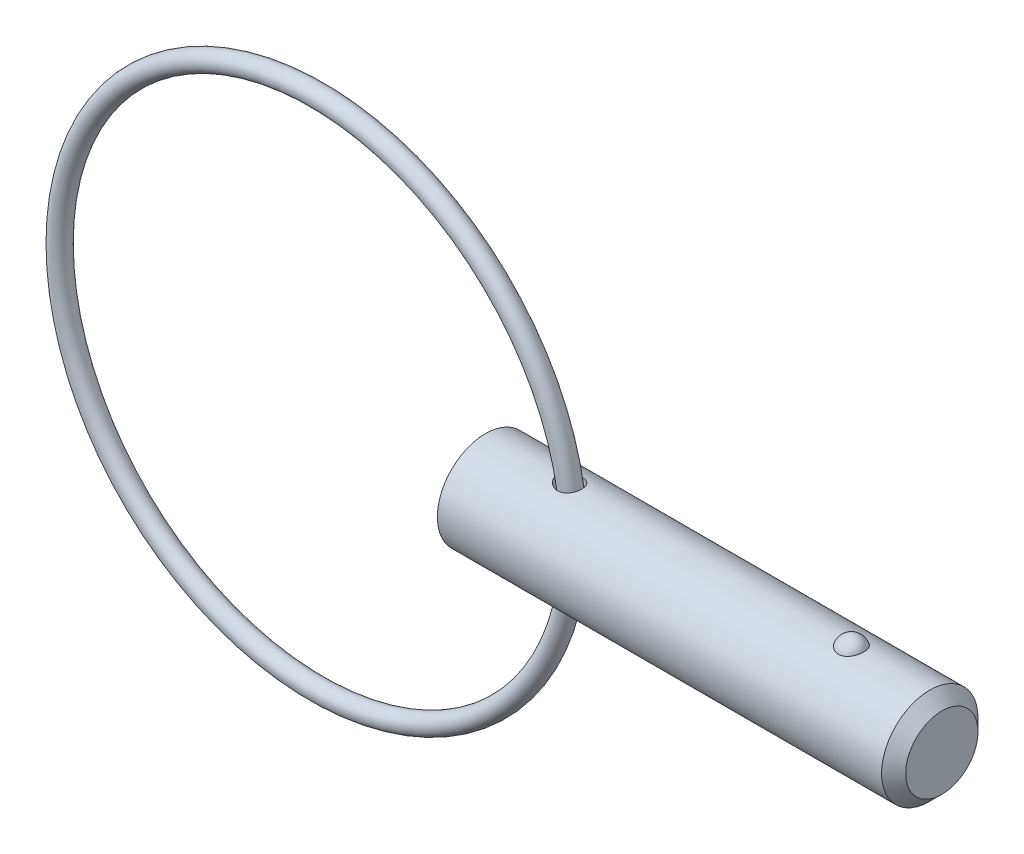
ISO-10303-21;
HEADER;
FILE_DESCRIPTION(('STEP AP214'),'2;1');
FILE_NAME('part.step','',(''),(''),'','','');
FILE_SCHEMA(('AUTOMOTIVE_DESIGN { 1 0 10303 214 1 1 1 1 }'));
ENDSEC;
DATA;
#1=APPLICATION_CONTEXT('core data for automotive mechanical design processes');
#2=APPLICATION_PROTOCOL_DEFINITION('international standard','automotive_design',2000,#1);
#3=PRODUCT_CONTEXT('',#1,'mechanical');
#4=PRODUCT('Part','Part','',(#3));
#5=PRODUCT_RELATED_PRODUCT_CATEGORY('part','',(#4));
#6=PRODUCT_DEFINITION_FORMATION('','',#4);
#7=PRODUCT_DEFINITION_CONTEXT('part definition',#1,'design');
#8=PRODUCT_DEFINITION('design','',#6,#7);
#9=PRODUCT_DEFINITION_SHAPE('','',#8);
#10=(LENGTH_UNIT() NAMED_UNIT(*) SI_UNIT(.MILLI.,.METRE.));
#11=(NAMED_UNIT(*) PLANE_ANGLE_UNIT() SI_UNIT($,.RADIAN.));
#12=(NAMED_UNIT(*) SI_UNIT($,.STERADIAN.) SOLID_ANGLE_UNIT());
#13=UNCERTAINTY_MEASURE_WITH_UNIT(LENGTH_MEASURE(1.E-05),#10,'distance_accuracy_value','');
#14=(GEOMETRIC_REPRESENTATION_CONTEXT(3) GLOBAL_UNCERTAINTY_ASSIGNED_CONTEXT((#13)) GLOBAL_UNIT_ASSIGNED_CONTEXT((#10,
#11,#12)) REPRESENTATION_CONTEXT('',''));
#15=CARTESIAN_POINT('',(0.,0.,0.));
#16=DIRECTION('',(0.,0.,1.));
#17=DIRECTION('',(1.,0.,0.));
#18=AXIS2_PLACEMENT_3D('',#15,#16,#17);
#19=CARTESIAN_POINT('',(-8.3302379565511,0.,0.));
#20=DIRECTION('',(0.,0.,1.));
#21=DIRECTION('',(1.,0.,0.));
#22=AXIS2_PLACEMENT_3D('',#19,#20,#21);
#23=TOROIDAL_SURFACE('',#22,12.7,0.476000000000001);
#24=CARTESIAN_POINT('',(4.8457620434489,0.,0.));
#25=VERTEX_POINT('',#24);
#26=VERTEX_LOOP('',#25);
#27=FACE_BOUND('',#26,.T.);
#28=ADVANCED_FACE('P0_F12',(#27),#23,.T.);
#29=CLOSED_SHELL('',(#28));
#30=MANIFOLD_SOLID_BREP('P0_B1',#29);
#31=CARTESIAN_POINT('',(0.,0.,0.));
#32=DIRECTION('',(1.,0.,0.));
#33=DIRECTION('',(0.,0.,-1.));
#34=AXIS2_PLACEMENT_3D('',#31,#32,#33);
#35=CYLINDRICAL_SURFACE('',#34,2.38);
#36=CARTESIAN_POINT('',(3.67748265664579,2.35074198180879,-0.372037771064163));
#37=CARTESIAN_POINT('',(3.70046616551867,2.34644965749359,-0.399158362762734));
#38=CARTESIAN_POINT('',(3.72581651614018,2.34199234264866,-0.424274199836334));
#39=CARTESIAN_POINT('',(3.78042747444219,2.33326580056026,-0.469907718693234));
#40=CARTESIAN_POINT('',(3.80969342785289,2.32899684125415,-0.490419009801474));
#41=CARTESIAN_POINT('',(3.87128330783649,2.32114904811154,-0.526312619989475));
#42=CARTESIAN_POINT('',(3.90360537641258,2.31756979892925,-0.541698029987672));
#43=CARTESIAN_POINT('',(3.9704452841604,2.31153734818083,-0.566889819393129));
#44=CARTESIAN_POINT('',(4.0049621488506,2.30908365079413,-0.576698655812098));
#45=CARTESIAN_POINT('',(4.07500735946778,2.30564492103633,-0.590297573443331));
#46=CARTESIAN_POINT('',(4.1105275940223,2.30465036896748,-0.594126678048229));
#47=CARTESIAN_POINT('',(4.18170718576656,2.30426876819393,-0.595606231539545));
#48=CARTESIAN_POINT('',(4.21736649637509,2.30488122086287,-0.593258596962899));
#49=CARTESIAN_POINT('',(4.28577822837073,2.30759475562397,-0.582609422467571));
#50=CARTESIAN_POINT('',(4.31858437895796,2.30961492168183,-0.574631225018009));
#51=CARTESIAN_POINT('',(4.38227060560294,2.31483318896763,-0.553233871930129));
#52=CARTESIAN_POINT('',(4.41315097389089,2.31803111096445,-0.539815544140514));
#53=CARTESIAN_POINT('',(4.4711825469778,2.3251225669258,-0.508384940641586));
#54=CARTESIAN_POINT('',(4.49841743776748,2.32899254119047,-0.490521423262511));
#55=CARTESIAN_POINT('',(4.5494826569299,2.33706025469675,-0.450515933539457));
#56=CARTESIAN_POINT('',(4.57331285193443,2.34125800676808,-0.42837379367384));
#57=CARTESIAN_POINT('',(4.6171621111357,2.34956202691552,-0.380209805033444));
#58=CARTESIAN_POINT('',(4.63714543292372,2.35366715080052,-0.354155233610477));
#59=CARTESIAN_POINT('',(4.67254725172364,2.36130301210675,-0.299034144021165));
#60=CARTESIAN_POINT('',(4.68796545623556,2.36483371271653,-0.26996743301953));
#61=CARTESIAN_POINT('',(4.71403776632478,2.37098548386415,-0.209215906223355));
#62=CARTESIAN_POINT('',(4.72462580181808,2.37359383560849,-0.177501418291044));
#63=CARTESIAN_POINT('',(4.74046966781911,2.37755210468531,-0.112692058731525));
#64=CARTESIAN_POINT('',(4.74572552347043,2.37890202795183,-0.0795971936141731));
#65=CARTESIAN_POINT('',(4.75077448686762,2.38019811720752,-0.0129544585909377));
#66=CARTESIAN_POINT('',(4.75056573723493,2.38014380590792,0.0205935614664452));
#67=CARTESIAN_POINT('',(4.74468604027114,2.37863606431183,0.0871753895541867));
#68=CARTESIAN_POINT('',(4.73901506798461,2.37718262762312,0.120209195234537));
#69=CARTESIAN_POINT('',(4.72236472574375,2.37303648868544,0.184779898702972));
#70=CARTESIAN_POINT('',(4.71139268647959,2.37034549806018,0.216318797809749));
#71=CARTESIAN_POINT('',(4.68441400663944,2.36401552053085,0.277063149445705));
#72=CARTESIAN_POINT('',(4.6684071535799,2.36037649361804,0.306268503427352));
#73=CARTESIAN_POINT('',(4.63170627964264,2.35253749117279,0.361595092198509));
#74=CARTESIAN_POINT('',(4.61100040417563,2.34833610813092,0.387708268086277));
#75=CARTESIAN_POINT('',(4.56544852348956,2.33984863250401,0.436017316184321));
#76=CARTESIAN_POINT('',(4.54060272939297,2.33556254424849,0.458213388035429));
#77=CARTESIAN_POINT('',(4.48760111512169,2.32742099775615,0.497916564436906));
#78=CARTESIAN_POINT('',(4.45946763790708,2.32356294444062,0.515452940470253));
#79=CARTESIAN_POINT('',(4.40055109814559,2.31668866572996,0.545520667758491));
#80=CARTESIAN_POINT('',(4.36976845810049,2.31367230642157,0.558052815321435));
#81=CARTESIAN_POINT('',(4.30694930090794,2.30886128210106,0.577633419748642));
#82=CARTESIAN_POINT('',(4.27493988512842,2.30704826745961,0.584764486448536));
#83=CARTESIAN_POINT('',(4.21014558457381,2.30475365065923,0.593744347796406));
#84=CARTESIAN_POINT('',(4.17736068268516,2.30427207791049,0.595593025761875));
#85=CARTESIAN_POINT('',(4.11170515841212,2.30466513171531,0.59406986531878));
#86=CARTESIAN_POINT('',(4.07883545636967,2.30554895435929,0.5906626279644));
#87=CARTESIAN_POINT('',(4.01408593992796,2.30856010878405,0.578780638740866));
#88=CARTESIAN_POINT('',(3.98220636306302,2.31068773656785,0.570304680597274));
#89=CARTESIAN_POINT('',(3.91877258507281,2.31605973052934,0.548090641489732));
#90=CARTESIAN_POINT('',(3.88730095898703,2.31935100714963,0.534128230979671));
#91=CARTESIAN_POINT('',(3.82705133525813,2.32664713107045,0.501391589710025));
#92=CARTESIAN_POINT('',(3.79827429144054,2.33065222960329,0.482615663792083));
#93=CARTESIAN_POINT('',(3.7429634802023,2.3391254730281,0.4397600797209));
#94=CARTESIAN_POINT('',(3.71658313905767,2.3436062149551,0.415484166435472));
#95=CARTESIAN_POINT('',(3.6683951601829,2.35235146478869,0.362706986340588));
#96=CARTESIAN_POINT('',(3.64658727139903,2.35661598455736,0.334205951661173));
#97=CARTESIAN_POINT('',(3.60882605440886,2.36432007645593,0.27436882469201));
#98=CARTESIAN_POINT('',(3.59274982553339,2.36777633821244,0.243112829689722));
#99=CARTESIAN_POINT('',(3.56652169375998,2.3735493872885,0.178112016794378));
#100=CARTESIAN_POINT('',(3.5563653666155,2.3758670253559,0.144369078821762));
#101=CARTESIAN_POINT('',(3.54309691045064,2.37891982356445,0.0783638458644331));
#102=CARTESIAN_POINT('',(3.53947205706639,2.37976992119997,0.0462095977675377));
#103=CARTESIAN_POINT('',(3.53785288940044,2.38014795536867,-0.018248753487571));
#104=CARTESIAN_POINT('',(3.5398575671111,2.37967612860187,-0.0505528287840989));
#105=CARTESIAN_POINT('',(3.54913867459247,2.37752661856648,-0.112617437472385));
#106=CARTESIAN_POINT('',(3.5561353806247,2.37591295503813,-0.142422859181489));
#107=CARTESIAN_POINT('',(3.5747775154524,2.37172196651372,-0.200451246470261));
#108=CARTESIAN_POINT('',(3.58642049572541,2.36914514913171,-0.228675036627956));
#109=CARTESIAN_POINT('',(3.61071901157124,2.36396321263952,-0.276620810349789));
#110=CARTESIAN_POINT('',(3.62251818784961,2.36150235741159,-0.296799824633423));
#111=CARTESIAN_POINT('',(3.64836661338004,2.35629864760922,-0.335619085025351));
#112=CARTESIAN_POINT('',(3.66241608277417,2.353555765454,-0.354259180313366));
#113=CARTESIAN_POINT('',(3.67748265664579,2.35074198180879,-0.372037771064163));
#114=B_SPLINE_CURVE_WITH_KNOTS('',3,(#36,#37,#38,#39,#40,#41,#42,#43,#44,#45,#46,#47,#48,#49,
#50,#51,#52,#53,#54,#55,#56,#57,#58,#59,#60,#61,#62,#63,#64,#65,#66,#67,#68,#69,#70,#71,#72,#73,
#74,#75,#76,#77,#78,#79,#80,#81,#82,#83,#84,#85,#86,#87,#88,#89,#90,#91,#92,#93,#94,#95,#96,#97,
#98,#99,#100,#101,#102,#103,#104,#105,#106,#107,#108,#109,#110,#111,#112,#113),.UNSPECIFIED.,
.T.,.F.,(4,2,2,2,2,2,2,2,2,2,2,2,2,2,2,2,2,2,2,2,2,2,2,2,2,2,2,2,2,2,2,2,2,2,2,2,2,2,4),(0.,
0.107335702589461,0.214819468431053,0.322238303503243,0.429609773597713,0.536277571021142,
0.642912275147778,0.743874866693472,0.844822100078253,0.942762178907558,1.04070609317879,
1.13952022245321,1.23834068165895,1.33847507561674,1.43860899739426,1.53877695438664,
1.63894536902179,1.7389756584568,1.83901017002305,1.93929990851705,2.03958453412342,
2.13922343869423,2.23884648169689,2.33691317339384,2.43498203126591,2.53371427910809,
2.63247003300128,2.73577311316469,2.83911262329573,2.94697761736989,3.05483668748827,
3.16021984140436,3.2655241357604,3.36212700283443,3.45871257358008,3.55027266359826,
3.64178456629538,3.71214035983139,3.78250304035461),.UNSPECIFIED.);
#115=CARTESIAN_POINT('',(3.67748265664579,2.35074198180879,-0.372037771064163));
#116=VERTEX_POINT('',#115);
#117=EDGE_CURVE('P1_E40',#116,#116,#114,.T.);
#118=ORIENTED_EDGE('',*,*,#117,.T.);
#119=EDGE_LOOP('',(#118));
#120=FACE_BOUND('',#119,.T.);
#121=CARTESIAN_POINT('',(21.935,0.,0.));
#122=DIRECTION('',(1.,0.,0.));
#123=DIRECTION('',(0.,0.,-1.));
#124=AXIS2_PLACEMENT_3D('',#121,#122,#123);
#125=CIRCLE('',#124,2.38);
#126=CARTESIAN_POINT('',(21.935,0.,-2.38));
#127=VERTEX_POINT('',#126);
#128=EDGE_CURVE('P1_E25',#127,#127,#125,.T.);
#129=ORIENTED_EDGE('',*,*,#128,.F.);
#130=EDGE_LOOP('',(#129));
#131=FACE_BOUND('',#130,.T.);
#132=CARTESIAN_POINT('',(0.,0.,0.));
#133=DIRECTION('',(1.,0.,0.));
#134=DIRECTION('',(0.,0.,-1.));
#135=AXIS2_PLACEMENT_3D('',#132,#133,#134);
#136=CIRCLE('',#135,2.38);
#137=CARTESIAN_POINT('',(0.,0.,-2.38));
#138=VERTEX_POINT('',#137);
#139=EDGE_CURVE('P1_E9',#138,#138,#136,.T.);
#140=ORIENTED_EDGE('',*,*,#139,.T.);
#141=EDGE_LOOP('',(#140));
#142=FACE_BOUND('',#141,.T.);
#143=CARTESIAN_POINT('',(18.0634492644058,2.2921568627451,0.640637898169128));
#144=CARTESIAN_POINT('',(18.0303559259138,2.29215737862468,0.640637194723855));
#145=CARTESIAN_POINT('',(17.9972546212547,2.29293179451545,0.637884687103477));
#146=CARTESIAN_POINT('',(17.9320176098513,2.29594030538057,0.626968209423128));
#147=CARTESIAN_POINT('',(17.8998823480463,2.29817506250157,0.618801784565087));
#148=CARTESIAN_POINT('',(17.8375402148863,2.30384308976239,0.597351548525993));
#149=CARTESIAN_POINT('',(17.8073305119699,2.30727454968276,0.584075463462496));
#150=CARTESIAN_POINT('',(17.7495674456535,2.31495941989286,0.55282960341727));
#151=CARTESIAN_POINT('',(17.7220141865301,2.31921286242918,0.53485964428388));
#152=CARTESIAN_POINT('',(17.6695938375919,2.32820213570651,0.494282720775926));
#153=CARTESIAN_POINT('',(17.6448050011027,2.33294694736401,0.471576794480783));
#154=CARTESIAN_POINT('',(17.5992169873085,2.34234144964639,0.422446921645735));
#155=CARTESIAN_POINT('',(17.5784185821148,2.34699112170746,0.396022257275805));
#156=CARTESIAN_POINT('',(17.5403580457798,2.35593942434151,0.338855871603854));
#157=CARTESIAN_POINT('',(17.5233051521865,2.36021170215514,0.30797060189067));
#158=CARTESIAN_POINT('',(17.4943607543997,2.3677057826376,0.24375057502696));
#159=CARTESIAN_POINT('',(17.4824701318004,2.37092740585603,0.210415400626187));
#160=CARTESIAN_POINT('',(17.4638076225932,2.37606901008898,0.141189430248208));
#161=CARTESIAN_POINT('',(17.4571956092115,2.37794816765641,0.105252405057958));
#162=CARTESIAN_POINT('',(17.4498095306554,2.38005135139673,0.0327351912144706));
#163=CARTESIAN_POINT('',(17.4490358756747,2.38027526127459,-0.00384504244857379));
#164=CARTESIAN_POINT('',(17.4533628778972,2.37903842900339,-0.0769838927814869));
#165=CARTESIAN_POINT('',(17.4585202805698,2.37756141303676,-0.113538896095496));
#166=CARTESIAN_POINT('',(17.4747013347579,2.37305303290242,-0.185229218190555));
#167=CARTESIAN_POINT('',(17.4857251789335,2.37002161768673,-0.220364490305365));
#168=CARTESIAN_POINT('',(17.5133977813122,2.36273722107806,-0.28815667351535));
#169=CARTESIAN_POINT('',(17.5300389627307,2.35848588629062,-0.320816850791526));
#170=CARTESIAN_POINT('',(17.5685984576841,2.34923130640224,-0.38274468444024));
#171=CARTESIAN_POINT('',(17.590516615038,2.34422808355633,-0.412012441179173));
#172=CARTESIAN_POINT('',(17.6387549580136,2.33412555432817,-0.465830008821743));
#173=CARTESIAN_POINT('',(17.665002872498,2.32902887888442,-0.490444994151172));
#174=CARTESIAN_POINT('',(17.7214769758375,2.31926941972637,-0.534700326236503));
#175=CARTESIAN_POINT('',(17.751702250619,2.3146065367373,-0.554341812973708));
#176=CARTESIAN_POINT('',(17.8140618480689,2.30645675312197,-0.587312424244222));
#177=CARTESIAN_POINT('',(17.8460780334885,2.30293152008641,-0.600855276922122));
#178=CARTESIAN_POINT('',(17.9120795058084,2.29725171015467,-0.62222045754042));
#179=CARTESIAN_POINT('',(17.9460641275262,2.29509667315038,-0.63004470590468));
#180=CARTESIAN_POINT('',(18.013299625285,2.29249264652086,-0.639452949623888));
#181=CARTESIAN_POINT('',(18.0465087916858,2.29196755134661,-0.641315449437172));
#182=CARTESIAN_POINT('',(18.112763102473,2.29246849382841,-0.639522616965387));
#183=CARTESIAN_POINT('',(18.1458082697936,2.29349430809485,-0.635868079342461));
#184=CARTESIAN_POINT('',(18.2101025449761,2.29694059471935,-0.623301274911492));
#185=CARTESIAN_POINT('',(18.2413744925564,2.29933234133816,-0.614497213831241));
#186=CARTESIAN_POINT('',(18.3019952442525,2.30522511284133,-0.592006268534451));
#187=CARTESIAN_POINT('',(18.3313438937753,2.30872622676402,-0.578318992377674));
#188=CARTESIAN_POINT('',(18.3880369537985,2.31655795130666,-0.546112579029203));
#189=CARTESIAN_POINT('',(18.415320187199,2.32090569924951,-0.527490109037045));
#190=CARTESIAN_POINT('',(18.4664904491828,2.32992206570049,-0.486117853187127));
#191=CARTESIAN_POINT('',(18.4903767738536,2.33459075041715,-0.463367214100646));
#192=CARTESIAN_POINT('',(18.5352722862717,2.34399834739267,-0.413220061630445));
#193=CARTESIAN_POINT('',(18.5560972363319,2.34873051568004,-0.385657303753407));
#194=CARTESIAN_POINT('',(18.593056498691,2.35754932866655,-0.327455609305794));
#195=CARTESIAN_POINT('',(18.6091898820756,2.36163584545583,-0.296816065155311));
#196=CARTESIAN_POINT('',(18.6369822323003,2.36889321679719,-0.232047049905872));
#197=CARTESIAN_POINT('',(18.6484450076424,2.37202275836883,-0.197828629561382));
#198=CARTESIAN_POINT('',(18.6657523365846,2.37681926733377,-0.127900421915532));
#199=CARTESIAN_POINT('',(18.6715962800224,2.37848607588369,-0.092190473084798));
#200=CARTESIAN_POINT('',(18.677605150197,2.38020024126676,-0.0196348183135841));
#201=CARTESIAN_POINT('',(18.6776704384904,2.38021918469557,0.0172198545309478));
#202=CARTESIAN_POINT('',(18.6718689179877,2.37856356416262,0.0904219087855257));
#203=CARTESIAN_POINT('',(18.6660018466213,2.37688892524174,0.12676926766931));
#204=CARTESIAN_POINT('',(18.648425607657,2.37201688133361,0.198028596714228));
#205=CARTESIAN_POINT('',(18.636699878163,2.36881516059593,0.23293619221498));
#206=CARTESIAN_POINT('',(18.6076354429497,2.36123444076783,0.300196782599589));
#207=CARTESIAN_POINT('',(18.5902967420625,2.3568554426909,0.332549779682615));
#208=CARTESIAN_POINT('',(18.5505350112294,2.34744667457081,0.393495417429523));
#209=CARTESIAN_POINT('',(18.5281528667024,2.34242227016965,0.422115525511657));
#210=CARTESIAN_POINT('',(18.4787391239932,2.33227293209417,0.475004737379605));
#211=CARTESIAN_POINT('',(18.4517076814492,2.32714800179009,0.4992739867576));
#212=CARTESIAN_POINT('',(18.3944988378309,2.31755359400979,0.542046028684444));
#213=CARTESIAN_POINT('',(18.3644297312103,2.31306986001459,0.560690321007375));
#214=CARTESIAN_POINT('',(18.3013869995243,2.3051412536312,0.592447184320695));
#215=CARTESIAN_POINT('',(18.2684158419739,2.30169550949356,0.605564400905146));
#216=CARTESIAN_POINT('',(18.2068424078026,2.29677744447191,0.623927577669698));
#217=CARTESIAN_POINT('',(18.1785555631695,2.29505839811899,0.630178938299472));
#218=CARTESIAN_POINT('',(18.1213308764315,2.29274795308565,0.638534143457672));
#219=CARTESIAN_POINT('',(18.0923931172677,2.29215641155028,0.64063851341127));
#220=CARTESIAN_POINT('',(18.0634492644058,2.2921568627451,0.640637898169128));
#221=B_SPLINE_CURVE_WITH_KNOTS('',3,(#143,#144,#145,#146,#147,#148,#149,#150,#151,#152,#153,
#154,#155,#156,#157,#158,#159,#160,#161,#162,#163,#164,#165,#166,#167,#168,#169,#170,#171,#172,
#173,#174,#175,#176,#177,#178,#179,#180,#181,#182,#183,#184,#185,#186,#187,#188,#189,#190,#191,
#192,#193,#194,#195,#196,#197,#198,#199,#200,#201,#202,#203,#204,#205,#206,#207,#208,#209,#210,
#211,#212,#213,#214,#215,#216,#217,#218,#219,#220),.UNSPECIFIED.,.T.,.F.,(4,2,2,2,2,2,2,2,2,2,2,
2,2,2,2,2,2,2,2,2,2,2,2,2,2,2,2,2,2,2,2,2,2,2,2,2,2,2,4),(0.,0.0991724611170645,
0.198389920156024,0.297457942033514,0.396529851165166,0.497927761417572,0.599345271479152,
0.705475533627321,0.811623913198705,0.920876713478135,1.03013718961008,1.1404517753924,
1.25076998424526,1.3609399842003,1.47110672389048,1.57959248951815,1.6880533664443,
1.79234266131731,1.89659691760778,1.99590391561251,2.0951966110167,2.19247425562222,
2.28975970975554,2.38926978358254,2.48880044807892,2.59293588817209,2.69709193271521,
2.80525821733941,2.91343624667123,3.02347917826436,3.13352698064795,3.24388765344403,
3.35424823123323,3.46374443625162,3.57323697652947,3.67968690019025,3.78604717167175,
3.87279565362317,3.95953314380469),.UNSPECIFIED.);
#222=CARTESIAN_POINT('',(18.0634492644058,2.2921568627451,0.640637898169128));
#223=VERTEX_POINT('',#222);
#224=EDGE_CURVE('P1_E34',#223,#223,#221,.T.);
#225=ORIENTED_EDGE('',*,*,#224,.T.);
#226=EDGE_LOOP('',(#225));
#227=FACE_BOUND('',#226,.T.);
#228=CARTESIAN_POINT('',(3.67748265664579,-2.35074198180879,-0.372037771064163));
#229=CARTESIAN_POINT('',(3.65652023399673,-2.35465684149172,-0.34730037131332));
#230=CARTESIAN_POINT('',(3.63751328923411,-2.35843676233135,-0.320880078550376));
#231=CARTESIAN_POINT('',(3.60404107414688,-2.36534227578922,-0.265218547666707));
#232=CARTESIAN_POINT('',(3.58957485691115,-2.36846800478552,-0.235977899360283));
#233=CARTESIAN_POINT('',(3.56572865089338,-2.37373250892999,-0.17528149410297));
#234=CARTESIAN_POINT('',(3.55636565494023,-2.37586798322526,-0.143818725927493));
#235=CARTESIAN_POINT('',(3.54325775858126,-2.37888184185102,-0.0796854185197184));
#236=CARTESIAN_POINT('',(3.539510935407,-2.37976065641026,-0.047015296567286));
#237=CARTESIAN_POINT('',(3.53787230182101,-2.38014359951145,0.0167788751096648));
#238=CARTESIAN_POINT('',(3.53968714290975,-2.37971660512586,0.0478953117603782));
#239=CARTESIAN_POINT('',(3.54844977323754,-2.37768530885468,0.10935299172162));
#240=CARTESIAN_POINT('',(3.55539746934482,-2.37608102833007,0.139694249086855));
#241=CARTESIAN_POINT('',(3.57400783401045,-2.37189301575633,0.198451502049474));
#242=CARTESIAN_POINT('',(3.58561918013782,-2.36931996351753,0.226884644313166));
#243=CARTESIAN_POINT('',(3.61310377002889,-2.36345094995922,0.281524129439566));
#244=CARTESIAN_POINT('',(3.62897804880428,-2.36015481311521,0.307729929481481));
#245=CARTESIAN_POINT('',(3.66562367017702,-2.35291979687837,0.359001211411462));
#246=CARTESIAN_POINT('',(3.68664499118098,-2.34895316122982,0.38388386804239));
#247=CARTESIAN_POINT('',(3.73230875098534,-2.34094029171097,0.430056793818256));
#248=CARTESIAN_POINT('',(3.75695270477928,-2.33689402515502,0.451345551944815));
#249=CARTESIAN_POINT('',(3.81128123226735,-2.32880869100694,0.491427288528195));
#250=CARTESIAN_POINT('',(3.84120889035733,-2.32479472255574,0.509896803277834));
#251=CARTESIAN_POINT('',(3.90376464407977,-2.31758417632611,0.541729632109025));
#252=CARTESIAN_POINT('',(3.93639323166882,-2.31438774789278,0.555092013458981));
#253=CARTESIAN_POINT('',(4.00416670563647,-2.30915137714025,0.576493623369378));
#254=CARTESIAN_POINT('',(4.0393485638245,-2.30713552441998,0.584422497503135));
#255=CARTESIAN_POINT('',(4.11060438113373,-2.30465258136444,0.594140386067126));
#256=CARTESIAN_POINT('',(4.14667802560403,-2.30418495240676,0.595931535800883));
#257=CARTESIAN_POINT('',(4.21693481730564,-2.30488473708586,0.593218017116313));
#258=CARTESIAN_POINT('',(4.25112951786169,-2.30597897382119,0.588995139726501));
#259=CARTESIAN_POINT('',(4.31821509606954,-2.30956729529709,0.57476284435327));
#260=CARTESIAN_POINT('',(4.35110629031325,-2.31206103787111,0.564754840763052));
#261=CARTESIAN_POINT('',(4.41316900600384,-2.31802118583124,0.53975368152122));
#262=CARTESIAN_POINT('',(4.44243993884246,-2.32144077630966,0.524995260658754));
#263=CARTESIAN_POINT('',(4.49802365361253,-2.32890801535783,0.49080792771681));
#264=CARTESIAN_POINT('',(4.52433643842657,-2.33295566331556,0.471379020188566));
#265=CARTESIAN_POINT('',(4.57327790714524,-2.3412242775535,0.428422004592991));
#266=CARTESIAN_POINT('',(4.59591094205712,-2.34544503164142,0.404898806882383));
#267=CARTESIAN_POINT('',(4.63697038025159,-2.35360640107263,0.354387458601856));
#268=CARTESIAN_POINT('',(4.65539647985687,-2.35754699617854,0.327399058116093));
#269=CARTESIAN_POINT('',(4.68784943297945,-2.36478461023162,0.270249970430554));
#270=CARTESIAN_POINT('',(4.70180333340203,-2.36807065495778,0.240046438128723));
#271=CARTESIAN_POINT('',(4.72457181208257,-2.3735656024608,0.177668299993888));
#272=CARTESIAN_POINT('',(4.73338630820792,-2.37577448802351,0.145493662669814));
#273=CARTESIAN_POINT('',(4.74568442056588,-2.37888446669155,0.0799353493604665));
#274=CARTESIAN_POINT('',(4.74914498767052,-2.37977990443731,0.0465470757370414));
#275=CARTESIAN_POINT('',(4.75057509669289,-2.38014803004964,-0.0203543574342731));
#276=CARTESIAN_POINT('',(4.74854468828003,-2.37962073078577,-0.0538675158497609));
#277=CARTESIAN_POINT('',(4.73905606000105,-2.37720346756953,-0.119981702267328));
#278=CARTESIAN_POINT('',(4.73161109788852,-2.37531683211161,-0.152584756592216));
#279=CARTESIAN_POINT('',(4.71149336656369,-2.37038779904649,-0.21604453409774));
#280=CARTESIAN_POINT('',(4.69882040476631,-2.36734535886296,-0.246901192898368));
#281=CARTESIAN_POINT('',(4.66852750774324,-2.3604270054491,-0.306062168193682));
#282=CARTESIAN_POINT('',(4.65089743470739,-2.35654938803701,-0.334361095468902));
#283=CARTESIAN_POINT('',(4.61113860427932,-2.34839114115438,-0.387535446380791));
#284=CARTESIAN_POINT('',(4.5890098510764,-2.34411051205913,-0.412410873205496));
#285=CARTESIAN_POINT('',(4.54086484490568,-2.33563475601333,-0.457982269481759));
#286=CARTESIAN_POINT('',(4.51485596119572,-2.33143948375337,-0.478685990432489));
#287=CARTESIAN_POINT('',(4.45962330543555,-2.32360655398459,-0.515369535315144));
#288=CARTESIAN_POINT('',(4.43040000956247,-2.31996881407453,-0.53135005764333));
#289=CARTESIAN_POINT('',(4.37002624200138,-2.31371771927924,-0.557938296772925));
#290=CARTESIAN_POINT('',(4.33891082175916,-2.31108995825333,-0.56862225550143));
#291=CARTESIAN_POINT('',(4.27527207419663,-2.30707117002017,-0.584715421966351));
#292=CARTESIAN_POINT('',(4.24274884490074,-2.30568005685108,-0.590124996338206));
#293=CARTESIAN_POINT('',(4.17738918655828,-2.30427145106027,-0.595601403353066));
#294=CARTESIAN_POINT('',(4.14455499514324,-2.3042474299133,-0.595693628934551));
#295=CARTESIAN_POINT('',(4.07930726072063,-2.30552664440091,-0.590722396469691));
#296=CARTESIAN_POINT('',(4.04689380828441,-2.3068301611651,-0.585657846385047));
#297=CARTESIAN_POINT('',(3.98220150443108,-2.31066076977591,-0.570360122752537));
#298=CARTESIAN_POINT('',(3.94996602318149,-2.31322859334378,-0.559954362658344));
#299=CARTESIAN_POINT('',(3.88760707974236,-2.31930140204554,-0.534242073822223));
#300=CARTESIAN_POINT('',(3.85748403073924,-2.32280656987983,-0.518934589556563));
#301=CARTESIAN_POINT('',(3.80033132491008,-2.33034138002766,-0.483968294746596));
#302=CARTESIAN_POINT('',(3.77327623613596,-2.33436601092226,-0.464349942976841));
#303=CARTESIAN_POINT('',(3.72262060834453,-2.34255524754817,-0.421092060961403));
#304=CARTESIAN_POINT('',(3.69901956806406,-2.34671983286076,-0.397453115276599));
#305=CARTESIAN_POINT('',(3.67748265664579,-2.35074198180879,-0.372037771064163));
#306=B_SPLINE_CURVE_WITH_KNOTS('',3,(#228,#229,#230,#231,#232,#233,#234,#235,#236,#237,#238,
#239,#240,#241,#242,#243,#244,#245,#246,#247,#248,#249,#250,#251,#252,#253,#254,#255,#256,#257,
#258,#259,#260,#261,#262,#263,#264,#265,#266,#267,#268,#269,#270,#271,#272,#273,#274,#275,#276,
#277,#278,#279,#280,#281,#282,#283,#284,#285,#286,#287,#288,#289,#290,#291,#292,#293,#294,#295,
#296,#297,#298,#299,#300,#301,#302,#303,#304,#305),.UNSPECIFIED.,.T.,.F.,(4,2,2,2,2,2,2,2,2,2,2,
2,2,2,2,2,2,2,2,2,2,2,2,2,2,2,2,2,2,2,2,2,2,2,2,2,2,2,4),(0.,0.09787553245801,0.19573064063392,
0.293909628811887,0.39205499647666,0.485114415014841,0.578172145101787,0.670232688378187,
0.762315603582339,0.860342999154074,0.958411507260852,1.06411708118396,1.16984195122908,
1.27765506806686,1.38543067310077,1.48831936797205,1.59118291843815,1.68959047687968,
1.78799793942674,1.88628818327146,1.98458551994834,2.08441314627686,2.18424236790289,
2.28450017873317,2.3847570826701,2.4847693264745,2.58478525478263,2.68500723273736,
2.78522911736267,2.8852630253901,2.98528213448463,3.08381637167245,3.18234375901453,
3.28040059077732,3.37847819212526,3.47994551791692,3.58143263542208,3.68200512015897,
3.78256299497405),.UNSPECIFIED.);
#307=CARTESIAN_POINT('',(3.67748265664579,-2.35074198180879,-0.372037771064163));
#308=VERTEX_POINT('',#307);
#309=EDGE_CURVE('P1_E17',#308,#308,#306,.T.);
#310=ORIENTED_EDGE('',*,*,#309,.T.);
#311=EDGE_LOOP('',(#310));
#312=FACE_BOUND('',#311,.T.);
#313=ADVANCED_FACE('P1_F13',(#120,#131,#142,#227,#312),#35,.T.);
#314=CARTESIAN_POINT('',(0.,0.,0.));
#315=DIRECTION('',(-1.,0.,0.));
#316=DIRECTION('',(0.,0.,1.));
#317=AXIS2_PLACEMENT_3D('',#314,#315,#316);
#318=PLANE('',#317);
#319=ORIENTED_EDGE('',*,*,#139,.F.);
#320=EDGE_LOOP('',(#319));
#321=FACE_BOUND('',#320,.T.);
#322=ADVANCED_FACE('P1_F15',(#321),#318,.T.);
#323=CARTESIAN_POINT('',(22.53,0.,0.));
#324=DIRECTION('',(-1.,0.,0.));
#325=DIRECTION('',(0.,0.,1.));
#326=AXIS2_PLACEMENT_3D('',#323,#324,#325);
#327=CONICAL_SURFACE('',#326,1.785,0.785398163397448);
#328=ORIENTED_EDGE('',*,*,#128,.T.);
#329=EDGE_LOOP('',(#328));
#330=FACE_BOUND('',#329,.T.);
#331=CARTESIAN_POINT('',(22.53,0.,0.));
#332=DIRECTION('',(1.,0.,0.));
#333=DIRECTION('',(0.,0.,-1.));
#334=AXIS2_PLACEMENT_3D('',#331,#332,#333);
#335=CIRCLE('',#334,1.785);
#336=CARTESIAN_POINT('',(22.53,0.,-1.785));
#337=VERTEX_POINT('',#336);
#338=EDGE_CURVE('P1_E30',#337,#337,#335,.T.);
#339=ORIENTED_EDGE('',*,*,#338,.F.);
#340=EDGE_LOOP('',(#339));
#341=FACE_BOUND('',#340,.T.);
#342=ADVANCED_FACE('P1_F55',(#330,#341),#327,.T.);
#343=CARTESIAN_POINT('',(22.53,1.785,0.));
#344=DIRECTION('',(1.,0.,0.));
#345=DIRECTION('',(0.,0.,-1.));
#346=AXIS2_PLACEMENT_3D('',#343,#344,#345);
#347=PLANE('',#346);
#348=ORIENTED_EDGE('',*,*,#338,.T.);
#349=EDGE_LOOP('',(#348));
#350=FACE_BOUND('',#349,.T.);
#351=ADVANCED_FACE('P1_F51',(#350),#347,.T.);
#352=CARTESIAN_POINT('',(18.0634492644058,2.142,0.));
#353=DIRECTION('',(-1.,0.,0.));
#354=DIRECTION('',(0.,1.,0.));
#355=AXIS2_PLACEMENT_3D('',#352,#353,#354);
#356=SPHERICAL_SURFACE('',#355,0.658000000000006);
#357=ORIENTED_EDGE('',*,*,#224,.F.);
#358=EDGE_LOOP('',(#357));
#359=FACE_BOUND('',#358,.T.);
#360=ADVANCED_FACE('P1_F46',(#359),#356,.T.);
#361=CARTESIAN_POINT('',(-8.3302379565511,0.,0.));
#362=DIRECTION('',(0.,0.,1.));
#363=DIRECTION('',(1.,0.,0.));
#364=AXIS2_PLACEMENT_3D('',#361,#362,#363);
#365=TOROIDAL_SURFACE('',#364,12.7,0.594999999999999);
#366=ORIENTED_EDGE('',*,*,#309,.F.);
#367=EDGE_LOOP('',(#366));
#368=FACE_BOUND('',#367,.T.);
#369=ORIENTED_EDGE('',*,*,#117,.F.);
#370=EDGE_LOOP('',(#369));
#371=FACE_BOUND('',#370,.T.);
#372=ADVANCED_FACE('P1_F50',(#368,#371),#365,.F.);
#373=CLOSED_SHELL('',(#313,#322,#342,#351,#360,#372));
#374=MANIFOLD_SOLID_BREP('P1_B1',#373);
#375=ADVANCED_BREP_SHAPE_REPRESENTATION('',(#18,#30,#374),#14);
#376=SHAPE_DEFINITION_REPRESENTATION(#9,#375);
ENDSEC;
END-ISO-10303-21;
